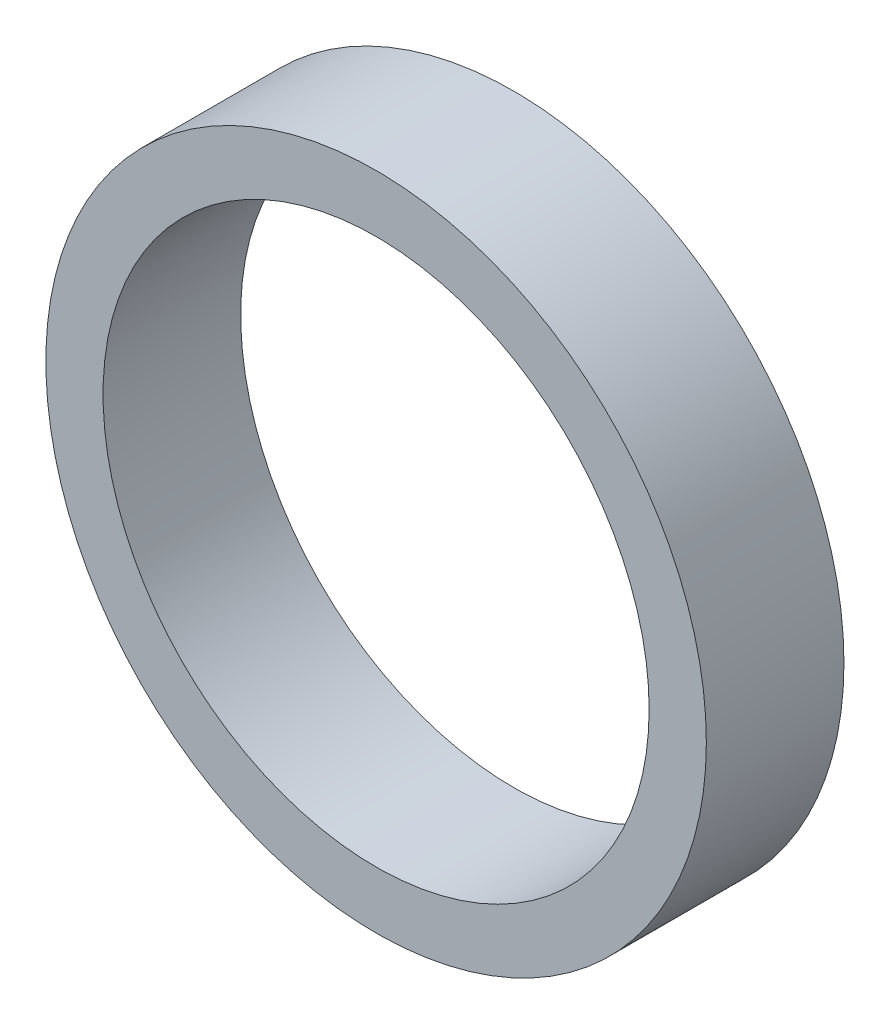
from build123d import *

# Parameters (mm, degrees)
SKETCH1_R           = 7.62
SKETCH1_R_2         = 6.3
BOSS_EXTRUDE1_DEPTH = 3.175


with BuildPart() as part:
    # Sketch1 → Boss-Extrude1 (new body)
    with BuildSketch(Plane.XY):
        Circle(SKETCH1_R)
        Circle(SKETCH1_R_2, mode=Mode.SUBTRACT)
    extrude(amount=BOSS_EXTRUDE1_DEPTH)


solid = part.part
